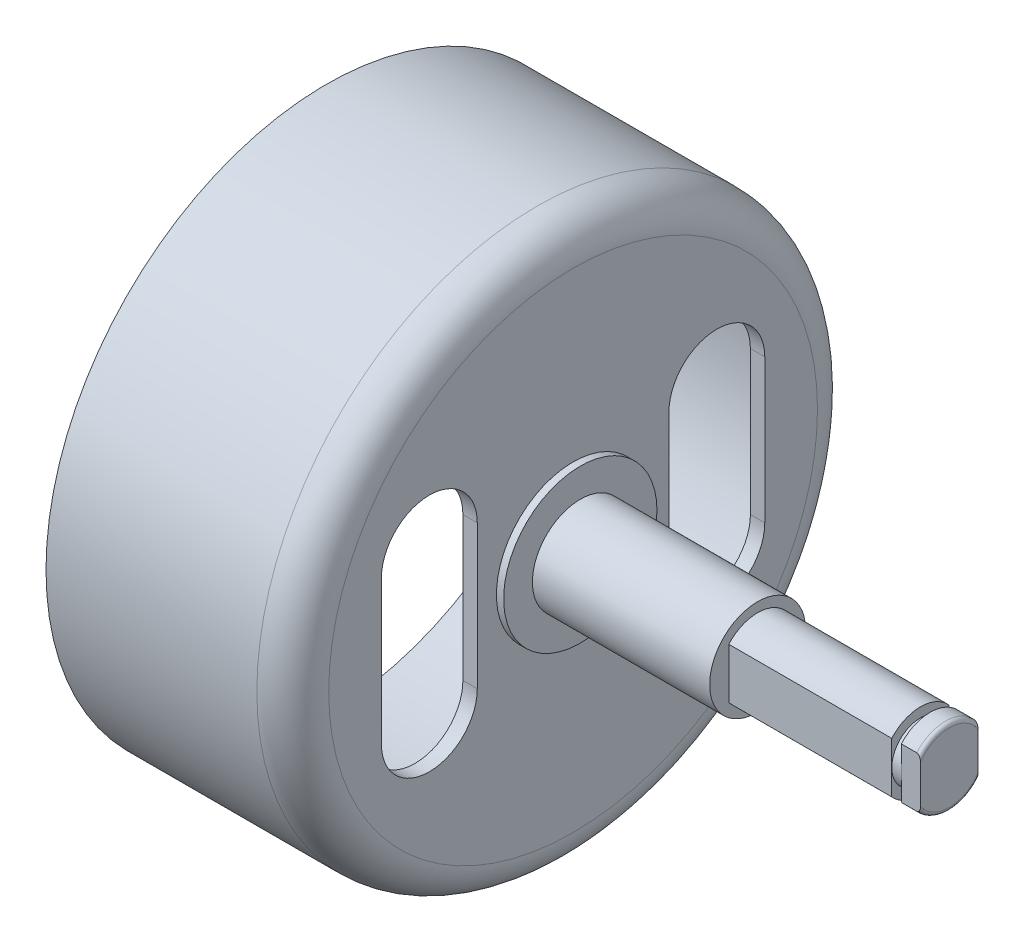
ISO-10303-21;
HEADER;
FILE_DESCRIPTION(('STEP AP214'),'2;1');
FILE_NAME('part.step','',(''),(''),'','','');
FILE_SCHEMA(('AUTOMOTIVE_DESIGN { 1 0 10303 214 1 1 1 1 }'));
ENDSEC;
DATA;
#1=APPLICATION_CONTEXT('core data for automotive mechanical design processes');
#2=APPLICATION_PROTOCOL_DEFINITION('international standard','automotive_design',2000,#1);
#3=PRODUCT_CONTEXT('',#1,'mechanical');
#4=PRODUCT('Part','Part','',(#3));
#5=PRODUCT_RELATED_PRODUCT_CATEGORY('part','',(#4));
#6=PRODUCT_DEFINITION_FORMATION('','',#4);
#7=PRODUCT_DEFINITION_CONTEXT('part definition',#1,'design');
#8=PRODUCT_DEFINITION('design','',#6,#7);
#9=PRODUCT_DEFINITION_SHAPE('','',#8);
#10=(LENGTH_UNIT() NAMED_UNIT(*) SI_UNIT(.MILLI.,.METRE.));
#11=(NAMED_UNIT(*) PLANE_ANGLE_UNIT() SI_UNIT($,.RADIAN.));
#12=(NAMED_UNIT(*) SI_UNIT($,.STERADIAN.) SOLID_ANGLE_UNIT());
#13=UNCERTAINTY_MEASURE_WITH_UNIT(LENGTH_MEASURE(1.E-05),#10,'distance_accuracy_value','');
#14=(GEOMETRIC_REPRESENTATION_CONTEXT(3) GLOBAL_UNCERTAINTY_ASSIGNED_CONTEXT((#13)) GLOBAL_UNIT_ASSIGNED_CONTEXT((#10,
#11,#12)) REPRESENTATION_CONTEXT('',''));
#15=CARTESIAN_POINT('',(0.,0.,0.));
#16=DIRECTION('',(0.,0.,1.));
#17=DIRECTION('',(1.,0.,0.));
#18=AXIS2_PLACEMENT_3D('',#15,#16,#17);
#19=CARTESIAN_POINT('',(39.6,0.,0.));
#20=DIRECTION('',(1.,0.,0.));
#21=DIRECTION('',(0.,0.99999889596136,0.00148595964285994));
#22=AXIS2_PLACEMENT_3D('',#19,#20,#21);
#23=TOROIDAL_SURFACE('',#22,3.6,0.4);
#24=CARTESIAN_POINT('',(40.,0.,0.));
#25=DIRECTION('',(-1.,0.,0.));
#26=DIRECTION('',(0.,-0.55277079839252,-0.833333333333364));
#27=AXIS2_PLACEMENT_3D('',#24,#25,#26);
#28=CIRCLE('',#27,3.59999999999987);
#29=CARTESIAN_POINT('',(40.,-3.59999602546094,-0.00534945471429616));
#30=VERTEX_POINT('',#29);
#31=CARTESIAN_POINT('',(40.,-1.989974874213,-3.));
#32=VERTEX_POINT('',#31);
#33=EDGE_CURVE('E385',#30,#32,#28,.F.);
#34=ORIENTED_EDGE('',*,*,#33,.F.);
#35=CARTESIAN_POINT('',(40.,0.,0.));
#36=DIRECTION('',(-1.,0.,0.));
#37=DIRECTION('',(0.,-0.999998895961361,-0.00148595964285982));
#38=AXIS2_PLACEMENT_3D('',#35,#36,#37);
#39=CIRCLE('',#38,3.6000000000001);
#40=CARTESIAN_POINT('',(40.,-1.98997487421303,3.00000000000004));
#41=VERTEX_POINT('',#40);
#42=EDGE_CURVE('E375',#41,#30,#39,.F.);
#43=ORIENTED_EDGE('',*,*,#42,.F.);
#44=CARTESIAN_POINT('',(40.,-1.98997487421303,3.));
#45=CARTESIAN_POINT('',(39.9999854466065,-2.02218015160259,3.));
#46=CARTESIAN_POINT('',(39.9988094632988,-2.05441692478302,3.));
#47=CARTESIAN_POINT('',(39.9937777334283,-2.11888113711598,3.));
#48=CARTESIAN_POINT('',(39.9899050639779,-2.15110722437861,3.));
#49=CARTESIAN_POINT('',(39.9790378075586,-2.21551711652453,3.));
#50=CARTESIAN_POINT('',(39.9719996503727,-2.24769381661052,3.00000000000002));
#51=CARTESIAN_POINT('',(39.954321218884,-2.31097519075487,2.99999999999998));
#52=CARTESIAN_POINT('',(39.9436915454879,-2.34208272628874,2.99999999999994));
#53=CARTESIAN_POINT('',(39.9212199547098,-2.3954558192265,2.99999999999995));
#54=CARTESIAN_POINT('',(39.9102468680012,-2.4180841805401,2.99999999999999));
#55=CARTESIAN_POINT('',(39.8855439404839,-2.4617702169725,3.00000000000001));
#56=CARTESIAN_POINT('',(39.8718182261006,-2.48283017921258,3.));
#57=CARTESIAN_POINT('',(39.8410999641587,-2.52292305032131,3.));
#58=CARTESIAN_POINT('',(39.8240652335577,-2.54192423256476,3.));
#59=CARTESIAN_POINT('',(39.7866918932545,-2.57636067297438,3.));
#60=CARTESIAN_POINT('',(39.7663633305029,-2.5918064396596,3.));
#61=CARTESIAN_POINT('',(39.7307308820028,-2.61287281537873,3.));
#62=CARTESIAN_POINT('',(39.7163246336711,-2.62001832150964,3.));
#63=CARTESIAN_POINT('',(39.6865490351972,-2.63186400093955,3.));
#64=CARTESIAN_POINT('',(39.671181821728,-2.63656939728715,3.));
#65=CARTESIAN_POINT('',(39.6464138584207,-2.64182701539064,3.));
#66=CARTESIAN_POINT('',(39.6371998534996,-2.643292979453,3.));
#67=CARTESIAN_POINT('',(39.618659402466,-2.64525721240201,3.));
#68=CARTESIAN_POINT('',(39.6093328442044,-2.64575441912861,3.));
#69=CARTESIAN_POINT('',(39.6,-2.64575131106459,3.));
#70=B_SPLINE_CURVE_WITH_KNOTS('',3,(#44,#45,#46,#47,#48,#49,#50,#51,#52,#53,#54,#55,#56,#57,#58,
#59,#60,#61,#62,#63,#64,#65,#66,#67,#68,#69),.UNSPECIFIED.,.F.,.F.,(4,2,2,2,2,2,2,2,2,2,2,2,4),
(0.,0.0966432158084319,0.193898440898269,0.292535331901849,0.390883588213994,0.466168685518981,
0.541341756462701,0.617544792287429,0.69351962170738,0.74158361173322,0.789544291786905,
0.817487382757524,0.845461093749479),.UNSPECIFIED.);
#71=CARTESIAN_POINT('',(39.6,-2.6457513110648,3.));
#72=VERTEX_POINT('',#71);
#73=EDGE_CURVE('E177',#41,#72,#70,.T.);
#74=ORIENTED_EDGE('',*,*,#73,.T.);
#75=CARTESIAN_POINT('',(39.6,0.,0.));
#76=DIRECTION('',(1.,0.,0.));
#77=DIRECTION('',(0.,0.,-1.));
#78=AXIS2_PLACEMENT_3D('',#75,#76,#77);
#79=CIRCLE('',#78,4.);
#80=CARTESIAN_POINT('',(39.6,-2.64575131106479,-3.));
#81=VERTEX_POINT('',#80);
#82=EDGE_CURVE('E172',#81,#72,#79,.F.);
#83=ORIENTED_EDGE('',*,*,#82,.F.);
#84=CARTESIAN_POINT('',(39.6,-2.64575131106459,-3.));
#85=CARTESIAN_POINT('',(39.6171201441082,-2.64579447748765,-3.));
#86=CARTESIAN_POINT('',(39.6341926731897,-2.64409273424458,-3.));
#87=CARTESIAN_POINT('',(39.6675754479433,-2.63757875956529,-3.));
#88=CARTESIAN_POINT('',(39.6838913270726,-2.63279575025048,-3.));
#89=CARTESIAN_POINT('',(39.7153847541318,-2.62050486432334,-3.));
#90=CARTESIAN_POINT('',(39.7305656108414,-2.61300531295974,-3.));
#91=CARTESIAN_POINT('',(39.7596153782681,-2.59575979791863,-3.));
#92=CARTESIAN_POINT('',(39.773480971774,-2.58600835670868,-3.));
#93=CARTESIAN_POINT('',(39.824287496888,-2.5448620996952,-3.));
#94=CARTESIAN_POINT('',(39.8560493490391,-2.50701337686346,-3.));
#95=CARTESIAN_POINT('',(39.9020393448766,-2.43498895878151,-3.));
#96=CARTESIAN_POINT('',(39.9186504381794,-2.40214024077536,-3.));
#97=CARTESIAN_POINT('',(39.946759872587,-2.33413869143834,-3.));
#98=CARTESIAN_POINT('',(39.958234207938,-2.2989759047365,-3.));
#99=CARTESIAN_POINT('',(39.9791069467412,-2.2183887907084,-3.));
#100=CARTESIAN_POINT('',(39.9872215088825,-2.17264234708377,-3.));
#101=CARTESIAN_POINT('',(39.9950441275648,-2.10392295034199,-3.));
#102=CARTESIAN_POINT('',(39.9969284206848,-2.08116006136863,-3.));
#103=CARTESIAN_POINT('',(39.9994042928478,-2.03559092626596,-3.));
#104=CARTESIAN_POINT('',(39.9999974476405,-2.01278476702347,-3.));
#105=CARTESIAN_POINT('',(40.,-1.989974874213,-3.));
#106=B_SPLINE_CURVE_WITH_KNOTS('',3,(#84,#85,#86,#87,#88,#89,#90,#91,#92,#93,#94,#95,#96,#97,
#98,#99,#100,#101,#102,#103,#104,#105),.UNSPECIFIED.,.F.,.F.,(4,2,2,2,2,2,2,2,2,2,4),(0.,
0.0512004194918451,0.101922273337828,0.152489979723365,0.203182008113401,0.348391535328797,
0.45846752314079,0.569052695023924,0.707953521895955,0.77644842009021,0.844859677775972),.UNSPECIFIED.);
#107=EDGE_CURVE('E174',#81,#32,#106,.T.);
#108=ORIENTED_EDGE('',*,*,#107,.T.);
#109=EDGE_LOOP('',(#34,#43,#74,#83,#108));
#110=FACE_BOUND('',#109,.T.);
#111=ADVANCED_FACE('F17',(#110),#23,.T.);
#112=CARTESIAN_POINT('',(39.6,0.,0.));
#113=DIRECTION('',(1.,0.,0.));
#114=DIRECTION('',(0.,-0.99999889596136,-0.00148595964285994));
#115=AXIS2_PLACEMENT_3D('',#112,#113,#114);
#116=TOROIDAL_SURFACE('',#115,3.6,0.4);
#117=CARTESIAN_POINT('',(40.,0.,0.));
#118=DIRECTION('',(-1.,0.,0.));
#119=DIRECTION('',(0.,0.55277079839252,0.833333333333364));
#120=AXIS2_PLACEMENT_3D('',#117,#118,#119);
#121=CIRCLE('',#120,3.59999999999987);
#122=CARTESIAN_POINT('',(40.,3.59999602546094,0.00534945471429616));
#123=VERTEX_POINT('',#122);
#124=CARTESIAN_POINT('',(40.,1.989974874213,3.));
#125=VERTEX_POINT('',#124);
#126=EDGE_CURVE('E182',#123,#125,#121,.F.);
#127=ORIENTED_EDGE('',*,*,#126,.F.);
#128=CARTESIAN_POINT('',(40.,0.,0.));
#129=DIRECTION('',(-1.,0.,0.));
#130=DIRECTION('',(0.,0.999998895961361,0.00148595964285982));
#131=AXIS2_PLACEMENT_3D('',#128,#129,#130);
#132=CIRCLE('',#131,3.6000000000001);
#133=CARTESIAN_POINT('',(40.,1.98997487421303,-3.00000000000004));
#134=VERTEX_POINT('',#133);
#135=EDGE_CURVE('E395',#134,#123,#132,.F.);
#136=ORIENTED_EDGE('',*,*,#135,.F.);
#137=CARTESIAN_POINT('',(40.,1.98997487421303,-3.));
#138=CARTESIAN_POINT('',(39.9999854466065,2.02218015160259,-3.));
#139=CARTESIAN_POINT('',(39.9988094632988,2.05441692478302,-3.));
#140=CARTESIAN_POINT('',(39.9937777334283,2.11888113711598,-3.));
#141=CARTESIAN_POINT('',(39.9899050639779,2.15110722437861,-3.));
#142=CARTESIAN_POINT('',(39.9790378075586,2.21551711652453,-3.));
#143=CARTESIAN_POINT('',(39.9719996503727,2.24769381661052,-3.00000000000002));
#144=CARTESIAN_POINT('',(39.954321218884,2.31097519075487,-2.99999999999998));
#145=CARTESIAN_POINT('',(39.9436915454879,2.34208272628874,-2.99999999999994));
#146=CARTESIAN_POINT('',(39.9212199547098,2.3954558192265,-2.99999999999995));
#147=CARTESIAN_POINT('',(39.9102468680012,2.4180841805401,-2.99999999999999));
#148=CARTESIAN_POINT('',(39.8855439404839,2.4617702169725,-3.00000000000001));
#149=CARTESIAN_POINT('',(39.8718182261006,2.48283017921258,-3.));
#150=CARTESIAN_POINT('',(39.8410999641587,2.52292305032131,-3.));
#151=CARTESIAN_POINT('',(39.8240652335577,2.54192423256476,-3.));
#152=CARTESIAN_POINT('',(39.7866918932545,2.57636067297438,-3.));
#153=CARTESIAN_POINT('',(39.7663633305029,2.5918064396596,-3.));
#154=CARTESIAN_POINT('',(39.7307308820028,2.61287281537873,-3.));
#155=CARTESIAN_POINT('',(39.7163246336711,2.62001832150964,-3.));
#156=CARTESIAN_POINT('',(39.6865490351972,2.63186400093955,-3.));
#157=CARTESIAN_POINT('',(39.671181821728,2.63656939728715,-3.));
#158=CARTESIAN_POINT('',(39.6464138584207,2.64182701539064,-3.));
#159=CARTESIAN_POINT('',(39.6371998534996,2.643292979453,-3.));
#160=CARTESIAN_POINT('',(39.618659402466,2.64525721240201,-3.));
#161=CARTESIAN_POINT('',(39.6093328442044,2.64575441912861,-3.));
#162=CARTESIAN_POINT('',(39.6,2.64575131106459,-3.));
#163=B_SPLINE_CURVE_WITH_KNOTS('',3,(#137,#138,#139,#140,#141,#142,#143,#144,#145,#146,#147,
#148,#149,#150,#151,#152,#153,#154,#155,#156,#157,#158,#159,#160,#161,#162),.UNSPECIFIED.,.F.,
.F.,(4,2,2,2,2,2,2,2,2,2,2,2,4),(0.,0.0966432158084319,0.193898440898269,0.292535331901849,
0.390883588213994,0.466168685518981,0.541341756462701,0.617544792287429,0.69351962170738,
0.74158361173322,0.789544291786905,0.817487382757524,0.845461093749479),.UNSPECIFIED.);
#164=CARTESIAN_POINT('',(39.6,2.6457513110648,-3.));
#165=VERTEX_POINT('',#164);
#166=EDGE_CURVE('E192',#134,#165,#163,.T.);
#167=ORIENTED_EDGE('',*,*,#166,.T.);
#168=CARTESIAN_POINT('',(39.6,0.,0.));
#169=DIRECTION('',(1.,0.,0.));
#170=DIRECTION('',(0.,0.,-1.));
#171=AXIS2_PLACEMENT_3D('',#168,#169,#170);
#172=CIRCLE('',#171,4.);
#173=CARTESIAN_POINT('',(39.6,2.64575131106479,3.));
#174=VERTEX_POINT('',#173);
#175=EDGE_CURVE('E181',#174,#165,#172,.F.);
#176=ORIENTED_EDGE('',*,*,#175,.F.);
#177=CARTESIAN_POINT('',(39.6,2.64575131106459,3.));
#178=CARTESIAN_POINT('',(39.6171201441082,2.64579447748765,3.));
#179=CARTESIAN_POINT('',(39.6341926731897,2.64409273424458,3.));
#180=CARTESIAN_POINT('',(39.6675754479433,2.63757875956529,3.));
#181=CARTESIAN_POINT('',(39.6838913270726,2.63279575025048,3.));
#182=CARTESIAN_POINT('',(39.7153847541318,2.62050486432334,3.));
#183=CARTESIAN_POINT('',(39.7305656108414,2.61300531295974,3.));
#184=CARTESIAN_POINT('',(39.7596153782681,2.59575979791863,3.));
#185=CARTESIAN_POINT('',(39.773480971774,2.58600835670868,3.));
#186=CARTESIAN_POINT('',(39.824287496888,2.5448620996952,3.));
#187=CARTESIAN_POINT('',(39.8560493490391,2.50701337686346,3.));
#188=CARTESIAN_POINT('',(39.9020393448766,2.43498895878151,3.));
#189=CARTESIAN_POINT('',(39.9186504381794,2.40214024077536,3.));
#190=CARTESIAN_POINT('',(39.946759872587,2.33413869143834,3.));
#191=CARTESIAN_POINT('',(39.958234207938,2.2989759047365,3.));
#192=CARTESIAN_POINT('',(39.9791069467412,2.2183887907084,3.));
#193=CARTESIAN_POINT('',(39.9872215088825,2.17264234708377,3.));
#194=CARTESIAN_POINT('',(39.9950441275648,2.10392295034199,3.));
#195=CARTESIAN_POINT('',(39.9969284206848,2.08116006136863,3.));
#196=CARTESIAN_POINT('',(39.9994042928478,2.03559092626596,3.));
#197=CARTESIAN_POINT('',(39.9999974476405,2.01278476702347,3.));
#198=CARTESIAN_POINT('',(40.,1.989974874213,3.));
#199=B_SPLINE_CURVE_WITH_KNOTS('',3,(#177,#178,#179,#180,#181,#182,#183,#184,#185,#186,#187,
#188,#189,#190,#191,#192,#193,#194,#195,#196,#197,#198),.UNSPECIFIED.,.F.,.F.,(4,2,2,2,2,2,2,2,
2,2,4),(0.,0.0512004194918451,0.101922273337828,0.152489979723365,0.203182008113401,
0.348391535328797,0.45846752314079,0.569052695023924,0.707953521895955,0.77644842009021,
0.844859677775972),.UNSPECIFIED.);
#200=EDGE_CURVE('E431',#174,#125,#199,.T.);
#201=ORIENTED_EDGE('',*,*,#200,.T.);
#202=EDGE_LOOP('',(#127,#136,#167,#176,#201));
#203=FACE_BOUND('',#202,.T.);
#204=ADVANCED_FACE('F349',(#203),#116,.T.);
#205=CARTESIAN_POINT('',(40.,0.,0.));
#206=DIRECTION('',(1.,0.,0.));
#207=DIRECTION('',(0.,0.,-1.));
#208=AXIS2_PLACEMENT_3D('',#205,#206,#207);
#209=PLANE('',#208);
#210=ORIENTED_EDGE('',*,*,#135,.T.);
#211=ORIENTED_EDGE('',*,*,#126,.T.);
#212=DIRECTION('',(0.,1.,0.));
#213=VECTOR('',#212,1.);
#214=CARTESIAN_POINT('',(40.,2.645751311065,3.));
#215=LINE('',#214,#213);
#216=EDGE_CURVE('E416',#41,#125,#215,.T.);
#217=ORIENTED_EDGE('',*,*,#216,.F.);
#218=ORIENTED_EDGE('',*,*,#42,.T.);
#219=ORIENTED_EDGE('',*,*,#33,.T.);
#220=DIRECTION('',(0.,1.,0.));
#221=VECTOR('',#220,1.);
#222=CARTESIAN_POINT('',(40.,-2.645751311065,-3.));
#223=LINE('',#222,#221);
#224=EDGE_CURVE('E191',#134,#32,#223,.F.);
#225=ORIENTED_EDGE('',*,*,#224,.F.);
#226=EDGE_LOOP('',(#210,#211,#217,#218,#219,#225));
#227=FACE_BOUND('',#226,.T.);
#228=ADVANCED_FACE('F360',(#227),#209,.T.);
#229=CARTESIAN_POINT('',(20.,0.,0.));
#230=DIRECTION('',(1.,0.,0.));
#231=DIRECTION('',(0.,0.,-1.));
#232=AXIS2_PLACEMENT_3D('',#229,#230,#231);
#233=CYLINDRICAL_SURFACE('',#232,4.);
#234=DIRECTION('',(1.,0.,0.));
#235=VECTOR('',#234,1.);
#236=CARTESIAN_POINT('',(20.,-2.645751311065,3.));
#237=LINE('',#236,#235);
#238=CARTESIAN_POINT('',(38.,-2.6457513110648,3.));
#239=VERTEX_POINT('',#238);
#240=EDGE_CURVE('E204',#239,#72,#237,.T.);
#241=ORIENTED_EDGE('',*,*,#240,.F.);
#242=CARTESIAN_POINT('',(38.,0.,0.));
#243=DIRECTION('',(1.,0.,0.));
#244=DIRECTION('',(0.,0.,-1.));
#245=AXIS2_PLACEMENT_3D('',#242,#243,#244);
#246=CIRCLE('',#245,4.);
#247=CARTESIAN_POINT('',(38.,-2.6457513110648,-3.));
#248=VERTEX_POINT('',#247);
#249=EDGE_CURVE('E196',#239,#248,#246,.T.);
#250=ORIENTED_EDGE('',*,*,#249,.T.);
#251=DIRECTION('',(-1.,0.,0.));
#252=VECTOR('',#251,1.);
#253=CARTESIAN_POINT('',(20.,-2.645751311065,-3.));
#254=LINE('',#253,#252);
#255=EDGE_CURVE('E188',#81,#248,#254,.T.);
#256=ORIENTED_EDGE('',*,*,#255,.F.);
#257=ORIENTED_EDGE('',*,*,#82,.T.);
#258=EDGE_LOOP('',(#241,#250,#256,#257));
#259=FACE_BOUND('',#258,.T.);
#260=ADVANCED_FACE('F194',(#259),#233,.T.);
#261=CARTESIAN_POINT('',(20.,0.,0.));
#262=DIRECTION('',(1.,0.,0.));
#263=DIRECTION('',(0.,0.,-1.));
#264=AXIS2_PLACEMENT_3D('',#261,#262,#263);
#265=CYLINDRICAL_SURFACE('',#264,4.);
#266=DIRECTION('',(-1.,0.,0.));
#267=VECTOR('',#266,1.);
#268=CARTESIAN_POINT('',(20.,2.645751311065,-3.));
#269=LINE('',#268,#267);
#270=CARTESIAN_POINT('',(38.,2.6457513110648,-3.));
#271=VERTEX_POINT('',#270);
#272=EDGE_CURVE('E201',#271,#165,#269,.F.);
#273=ORIENTED_EDGE('',*,*,#272,.F.);
#274=CARTESIAN_POINT('',(38.,0.,0.));
#275=DIRECTION('',(1.,0.,0.));
#276=DIRECTION('',(0.,0.,-1.));
#277=AXIS2_PLACEMENT_3D('',#274,#275,#276);
#278=CIRCLE('',#277,4.);
#279=CARTESIAN_POINT('',(38.,2.6457513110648,3.));
#280=VERTEX_POINT('',#279);
#281=EDGE_CURVE('E213',#271,#280,#278,.T.);
#282=ORIENTED_EDGE('',*,*,#281,.T.);
#283=DIRECTION('',(1.,0.,0.));
#284=VECTOR('',#283,1.);
#285=CARTESIAN_POINT('',(20.,2.645751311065,3.));
#286=LINE('',#285,#284);
#287=EDGE_CURVE('E211',#174,#280,#286,.F.);
#288=ORIENTED_EDGE('',*,*,#287,.F.);
#289=ORIENTED_EDGE('',*,*,#175,.T.);
#290=EDGE_LOOP('',(#273,#282,#288,#289));
#291=FACE_BOUND('',#290,.T.);
#292=ADVANCED_FACE('F443',(#291),#265,.T.);
#293=CARTESIAN_POINT('',(20.,2.645751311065,3.));
#294=DIRECTION('',(0.,0.,1.));
#295=DIRECTION('',(1.,0.,0.));
#296=AXIS2_PLACEMENT_3D('',#293,#294,#295);
#297=PLANE('',#296);
#298=ORIENTED_EDGE('',*,*,#287,.T.);
#299=DIRECTION('',(0.,1.,0.));
#300=VECTOR('',#299,1.);
#301=CARTESIAN_POINT('',(38.,0.,3.));
#302=LINE('',#301,#300);
#303=CARTESIAN_POINT('',(38.,0.,3.));
#304=VERTEX_POINT('',#303);
#305=EDGE_CURVE('E219',#280,#304,#302,.F.);
#306=ORIENTED_EDGE('',*,*,#305,.T.);
#307=DIRECTION('',(0.,1.,0.));
#308=VECTOR('',#307,1.);
#309=CARTESIAN_POINT('',(38.,0.,3.));
#310=LINE('',#309,#308);
#311=EDGE_CURVE('E197',#304,#239,#310,.F.);
#312=ORIENTED_EDGE('',*,*,#311,.T.);
#313=ORIENTED_EDGE('',*,*,#240,.T.);
#314=ORIENTED_EDGE('',*,*,#73,.F.);
#315=ORIENTED_EDGE('',*,*,#216,.T.);
#316=ORIENTED_EDGE('',*,*,#200,.F.);
#317=EDGE_LOOP('',(#298,#306,#312,#313,#314,#315,#316));
#318=FACE_BOUND('',#317,.T.);
#319=ADVANCED_FACE('F420',(#318),#297,.T.);
#320=CARTESIAN_POINT('',(20.,-2.645751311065,-3.));
#321=DIRECTION('',(0.,0.,-1.));
#322=DIRECTION('',(-1.,0.,0.));
#323=AXIS2_PLACEMENT_3D('',#320,#321,#322);
#324=PLANE('',#323);
#325=ORIENTED_EDGE('',*,*,#255,.T.);
#326=DIRECTION('',(0.,1.,0.));
#327=VECTOR('',#326,1.);
#328=CARTESIAN_POINT('',(38.,0.,-3.));
#329=LINE('',#328,#327);
#330=CARTESIAN_POINT('',(38.,0.,-3.));
#331=VERTEX_POINT('',#330);
#332=EDGE_CURVE('E212',#248,#331,#329,.T.);
#333=ORIENTED_EDGE('',*,*,#332,.T.);
#334=DIRECTION('',(0.,1.,0.));
#335=VECTOR('',#334,1.);
#336=CARTESIAN_POINT('',(38.,0.,-3.));
#337=LINE('',#336,#335);
#338=EDGE_CURVE('E215',#331,#271,#337,.T.);
#339=ORIENTED_EDGE('',*,*,#338,.T.);
#340=ORIENTED_EDGE('',*,*,#272,.T.);
#341=ORIENTED_EDGE('',*,*,#166,.F.);
#342=ORIENTED_EDGE('',*,*,#224,.T.);
#343=ORIENTED_EDGE('',*,*,#107,.F.);
#344=EDGE_LOOP('',(#325,#333,#339,#340,#341,#342,#343));
#345=FACE_BOUND('',#344,.T.);
#346=ADVANCED_FACE('F187',(#345),#324,.T.);
#347=CARTESIAN_POINT('',(38.,0.,0.));
#348=DIRECTION('',(1.,0.,0.));
#349=DIRECTION('',(0.,0.,-1.));
#350=AXIS2_PLACEMENT_3D('',#347,#348,#349);
#351=PLANE('',#350);
#352=ORIENTED_EDGE('',*,*,#332,.F.);
#353=ORIENTED_EDGE('',*,*,#249,.F.);
#354=ORIENTED_EDGE('',*,*,#311,.F.);
#355=CARTESIAN_POINT('',(38.,0.,0.));
#356=DIRECTION('',(1.,0.,0.));
#357=DIRECTION('',(0.,0.,-1.));
#358=AXIS2_PLACEMENT_3D('',#355,#356,#357);
#359=CIRCLE('',#358,3.);
#360=EDGE_CURVE('E218',#331,#304,#359,.F.);
#361=ORIENTED_EDGE('',*,*,#360,.F.);
#362=EDGE_LOOP('',(#352,#353,#354,#361));
#363=FACE_BOUND('',#362,.T.);
#364=ADVANCED_FACE('F426',(#363),#351,.F.);
#365=CARTESIAN_POINT('',(38.,0.,0.));
#366=DIRECTION('',(1.,0.,0.));
#367=DIRECTION('',(0.,0.,-1.));
#368=AXIS2_PLACEMENT_3D('',#365,#366,#367);
#369=PLANE('',#368);
#370=CARTESIAN_POINT('',(38.,0.,0.));
#371=DIRECTION('',(1.,0.,0.));
#372=DIRECTION('',(0.,0.,-1.));
#373=AXIS2_PLACEMENT_3D('',#370,#371,#372);
#374=CIRCLE('',#373,3.);
#375=EDGE_CURVE('E549',#304,#331,#374,.F.);
#376=ORIENTED_EDGE('',*,*,#375,.F.);
#377=ORIENTED_EDGE('',*,*,#305,.F.);
#378=ORIENTED_EDGE('',*,*,#281,.F.);
#379=ORIENTED_EDGE('',*,*,#338,.F.);
#380=EDGE_LOOP('',(#376,#377,#378,#379));
#381=FACE_BOUND('',#380,.T.);
#382=ADVANCED_FACE('F556',(#381),#369,.F.);
#383=CARTESIAN_POINT('',(38.,0.,0.));
#384=DIRECTION('',(1.,0.,0.));
#385=DIRECTION('',(0.,0.,-1.));
#386=AXIS2_PLACEMENT_3D('',#383,#384,#385);
#387=CYLINDRICAL_SURFACE('',#386,3.);
#388=CARTESIAN_POINT('',(37.,0.,0.));
#389=DIRECTION('',(1.,0.,0.));
#390=DIRECTION('',(0.,0.,-1.));
#391=AXIS2_PLACEMENT_3D('',#388,#389,#390);
#392=CIRCLE('',#391,3.);
#393=CARTESIAN_POINT('',(37.,0.,-3.));
#394=VERTEX_POINT('',#393);
#395=CARTESIAN_POINT('',(37.,0.,3.));
#396=VERTEX_POINT('',#395);
#397=EDGE_CURVE('E546',#394,#396,#392,.F.);
#398=ORIENTED_EDGE('',*,*,#397,.F.);
#399=CARTESIAN_POINT('',(37.,0.,0.));
#400=DIRECTION('',(1.,0.,0.));
#401=DIRECTION('',(0.,0.,-1.));
#402=AXIS2_PLACEMENT_3D('',#399,#400,#401);
#403=CIRCLE('',#402,3.);
#404=EDGE_CURVE('E329',#396,#394,#403,.F.);
#405=ORIENTED_EDGE('',*,*,#404,.F.);
#406=EDGE_LOOP('',(#398,#405));
#407=FACE_BOUND('',#406,.T.);
#408=ORIENTED_EDGE('',*,*,#375,.T.);
#409=ORIENTED_EDGE('',*,*,#360,.T.);
#410=EDGE_LOOP('',(#408,#409));
#411=FACE_BOUND('',#410,.T.);
#412=ADVANCED_FACE('F553',(#407,#411),#387,.T.);
#413=CARTESIAN_POINT('',(37.,0.,0.));
#414=DIRECTION('',(1.,0.,0.));
#415=DIRECTION('',(0.,0.,-1.));
#416=AXIS2_PLACEMENT_3D('',#413,#414,#415);
#417=PLANE('',#416);
#418=ORIENTED_EDGE('',*,*,#397,.T.);
#419=DIRECTION('',(0.,1.,0.));
#420=VECTOR('',#419,1.);
#421=CARTESIAN_POINT('',(37.,2.645751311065,3.));
#422=LINE('',#421,#420);
#423=CARTESIAN_POINT('',(37.,-2.6457513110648,3.));
#424=VERTEX_POINT('',#423);
#425=EDGE_CURVE('E319',#424,#396,#422,.T.);
#426=ORIENTED_EDGE('',*,*,#425,.F.);
#427=CARTESIAN_POINT('',(37.,0.,0.));
#428=DIRECTION('',(1.,0.,0.));
#429=DIRECTION('',(0.,0.,-1.));
#430=AXIS2_PLACEMENT_3D('',#427,#428,#429);
#431=CIRCLE('',#430,4.);
#432=CARTESIAN_POINT('',(37.,-2.64575131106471,-2.9999999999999));
#433=VERTEX_POINT('',#432);
#434=EDGE_CURVE('E320',#433,#424,#431,.F.);
#435=ORIENTED_EDGE('',*,*,#434,.F.);
#436=DIRECTION('',(0.,1.,0.));
#437=VECTOR('',#436,1.);
#438=CARTESIAN_POINT('',(37.,-2.645751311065,-3.));
#439=LINE('',#438,#437);
#440=EDGE_CURVE('E324',#394,#433,#439,.F.);
#441=ORIENTED_EDGE('',*,*,#440,.F.);
#442=EDGE_LOOP('',(#418,#426,#435,#441));
#443=FACE_BOUND('',#442,.T.);
#444=ADVANCED_FACE('F675',(#443),#417,.T.);
#445=CARTESIAN_POINT('',(37.,0.,0.));
#446=DIRECTION('',(1.,0.,0.));
#447=DIRECTION('',(0.,0.,-1.));
#448=AXIS2_PLACEMENT_3D('',#445,#446,#447);
#449=PLANE('',#448);
#450=DIRECTION('',(0.,1.,0.));
#451=VECTOR('',#450,1.);
#452=CARTESIAN_POINT('',(37.,-2.645751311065,-3.));
#453=LINE('',#452,#451);
#454=CARTESIAN_POINT('',(37.,2.64575131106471,-2.9999999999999));
#455=VERTEX_POINT('',#454);
#456=EDGE_CURVE('E326',#455,#394,#453,.F.);
#457=ORIENTED_EDGE('',*,*,#456,.F.);
#458=CARTESIAN_POINT('',(37.,0.,0.));
#459=DIRECTION('',(1.,0.,0.));
#460=DIRECTION('',(0.,0.,-1.));
#461=AXIS2_PLACEMENT_3D('',#458,#459,#460);
#462=CIRCLE('',#461,4.);
#463=CARTESIAN_POINT('',(37.,2.64575131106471,2.9999999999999));
#464=VERTEX_POINT('',#463);
#465=EDGE_CURVE('E229',#464,#455,#462,.F.);
#466=ORIENTED_EDGE('',*,*,#465,.F.);
#467=DIRECTION('',(0.,1.,0.));
#468=VECTOR('',#467,1.);
#469=CARTESIAN_POINT('',(37.,2.645751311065,3.));
#470=LINE('',#469,#468);
#471=EDGE_CURVE('E313',#396,#464,#470,.T.);
#472=ORIENTED_EDGE('',*,*,#471,.F.);
#473=ORIENTED_EDGE('',*,*,#404,.T.);
#474=EDGE_LOOP('',(#457,#466,#472,#473));
#475=FACE_BOUND('',#474,.T.);
#476=ADVANCED_FACE('F671',(#475),#449,.T.);
#477=CARTESIAN_POINT('',(20.,-2.645751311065,-3.));
#478=DIRECTION('',(0.,0.,-1.));
#479=DIRECTION('',(-1.,0.,0.));
#480=AXIS2_PLACEMENT_3D('',#477,#478,#479);
#481=PLANE('',#480);
#482=ORIENTED_EDGE('',*,*,#456,.T.);
#483=ORIENTED_EDGE('',*,*,#440,.T.);
#484=DIRECTION('',(1.,0.,0.));
#485=VECTOR('',#484,1.);
#486=CARTESIAN_POINT('',(20.,-2.64575131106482,-2.9999999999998));
#487=LINE('',#486,#485);
#488=CARTESIAN_POINT('',(20.,-2.64575131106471,-2.9999999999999));
#489=VERTEX_POINT('',#488);
#490=EDGE_CURVE('E321',#489,#433,#487,.T.);
#491=ORIENTED_EDGE('',*,*,#490,.F.);
#492=DIRECTION('',(0.,1.,0.));
#493=VECTOR('',#492,1.);
#494=CARTESIAN_POINT('',(20.,0.,-3.));
#495=LINE('',#494,#493);
#496=CARTESIAN_POINT('',(20.,2.64575131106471,-2.9999999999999));
#497=VERTEX_POINT('',#496);
#498=EDGE_CURVE('E226',#497,#489,#495,.F.);
#499=ORIENTED_EDGE('',*,*,#498,.F.);
#500=DIRECTION('',(1.,0.,0.));
#501=VECTOR('',#500,1.);
#502=CARTESIAN_POINT('',(20.,2.64575131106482,-2.9999999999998));
#503=LINE('',#502,#501);
#504=EDGE_CURVE('E309',#455,#497,#503,.F.);
#505=ORIENTED_EDGE('',*,*,#504,.F.);
#506=EDGE_LOOP('',(#482,#483,#491,#499,#505));
#507=FACE_BOUND('',#506,.T.);
#508=ADVANCED_FACE('F667',(#507),#481,.T.);
#509=CARTESIAN_POINT('',(20.,0.,0.));
#510=DIRECTION('',(1.,0.,0.));
#511=DIRECTION('',(0.,0.,-1.));
#512=AXIS2_PLACEMENT_3D('',#509,#510,#511);
#513=CYLINDRICAL_SURFACE('',#512,4.);
#514=ORIENTED_EDGE('',*,*,#490,.T.);
#515=ORIENTED_EDGE('',*,*,#434,.T.);
#516=DIRECTION('',(1.,0.,0.));
#517=VECTOR('',#516,1.);
#518=CARTESIAN_POINT('',(20.,-2.645751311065,3.));
#519=LINE('',#518,#517);
#520=CARTESIAN_POINT('',(20.,-2.6457513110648,3.));
#521=VERTEX_POINT('',#520);
#522=EDGE_CURVE('E316',#521,#424,#519,.T.);
#523=ORIENTED_EDGE('',*,*,#522,.F.);
#524=CARTESIAN_POINT('',(20.,0.,0.));
#525=DIRECTION('',(1.,0.,0.));
#526=DIRECTION('',(0.,0.,-1.));
#527=AXIS2_PLACEMENT_3D('',#524,#525,#526);
#528=CIRCLE('',#527,4.);
#529=EDGE_CURVE('E225',#489,#521,#528,.F.);
#530=ORIENTED_EDGE('',*,*,#529,.F.);
#531=EDGE_LOOP('',(#514,#515,#523,#530));
#532=FACE_BOUND('',#531,.T.);
#533=ADVANCED_FACE('F663',(#532),#513,.T.);
#534=CARTESIAN_POINT('',(20.,2.645751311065,3.));
#535=DIRECTION('',(0.,0.,1.));
#536=DIRECTION('',(1.,0.,0.));
#537=AXIS2_PLACEMENT_3D('',#534,#535,#536);
#538=PLANE('',#537);
#539=ORIENTED_EDGE('',*,*,#425,.T.);
#540=ORIENTED_EDGE('',*,*,#471,.T.);
#541=DIRECTION('',(1.,0.,0.));
#542=VECTOR('',#541,1.);
#543=CARTESIAN_POINT('',(20.,2.64575131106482,2.9999999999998));
#544=LINE('',#543,#542);
#545=CARTESIAN_POINT('',(20.,2.64575131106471,2.9999999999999));
#546=VERTEX_POINT('',#545);
#547=EDGE_CURVE('E312',#546,#464,#544,.T.);
#548=ORIENTED_EDGE('',*,*,#547,.F.);
#549=DIRECTION('',(0.,1.,0.));
#550=VECTOR('',#549,1.);
#551=CARTESIAN_POINT('',(20.,0.,3.));
#552=LINE('',#551,#550);
#553=EDGE_CURVE('E221',#521,#546,#552,.T.);
#554=ORIENTED_EDGE('',*,*,#553,.F.);
#555=ORIENTED_EDGE('',*,*,#522,.T.);
#556=EDGE_LOOP('',(#539,#540,#548,#554,#555));
#557=FACE_BOUND('',#556,.T.);
#558=ADVANCED_FACE('F659',(#557),#538,.T.);
#559=CARTESIAN_POINT('',(20.,0.,0.));
#560=DIRECTION('',(1.,0.,0.));
#561=DIRECTION('',(0.,0.,-1.));
#562=AXIS2_PLACEMENT_3D('',#559,#560,#561);
#563=CYLINDRICAL_SURFACE('',#562,4.);
#564=ORIENTED_EDGE('',*,*,#547,.T.);
#565=ORIENTED_EDGE('',*,*,#465,.T.);
#566=ORIENTED_EDGE('',*,*,#504,.T.);
#567=CARTESIAN_POINT('',(20.,0.,0.));
#568=DIRECTION('',(1.,0.,0.));
#569=DIRECTION('',(0.,0.,-1.));
#570=AXIS2_PLACEMENT_3D('',#567,#568,#569);
#571=CIRCLE('',#570,4.);
#572=EDGE_CURVE('E224',#546,#497,#571,.F.);
#573=ORIENTED_EDGE('',*,*,#572,.F.);
#574=EDGE_LOOP('',(#564,#565,#566,#573));
#575=FACE_BOUND('',#574,.T.);
#576=ADVANCED_FACE('F655',(#575),#563,.T.);
#577=CARTESIAN_POINT('',(20.,0.,0.));
#578=DIRECTION('',(1.,0.,0.));
#579=DIRECTION('',(0.,0.,-1.));
#580=AXIS2_PLACEMENT_3D('',#577,#578,#579);
#581=PLANE('',#580);
#582=ORIENTED_EDGE('',*,*,#553,.T.);
#583=ORIENTED_EDGE('',*,*,#572,.T.);
#584=ORIENTED_EDGE('',*,*,#498,.T.);
#585=ORIENTED_EDGE('',*,*,#529,.T.);
#586=EDGE_LOOP('',(#582,#583,#584,#585));
#587=FACE_BOUND('',#586,.T.);
#588=CARTESIAN_POINT('',(20.,0.,0.));
#589=DIRECTION('',(1.,0.,0.));
#590=DIRECTION('',(0.,0.,-1.));
#591=AXIS2_PLACEMENT_3D('',#588,#589,#590);
#592=CIRCLE('',#591,5.);
#593=CARTESIAN_POINT('',(20.,0.,-5.));
#594=VERTEX_POINT('',#593);
#595=EDGE_CURVE('E534',#594,#594,#592,.F.);
#596=ORIENTED_EDGE('',*,*,#595,.F.);
#597=EDGE_LOOP('',(#596));
#598=FACE_BOUND('',#597,.T.);
#599=ADVANCED_FACE('F651',(#587,#598),#581,.T.);
#600=CARTESIAN_POINT('',(-3.,0.,0.));
#601=DIRECTION('',(1.,0.,0.));
#602=DIRECTION('',(0.,0.,-1.));
#603=AXIS2_PLACEMENT_3D('',#600,#601,#602);
#604=PLANE('',#603);
#605=CARTESIAN_POINT('',(-3.,0.,0.));
#606=DIRECTION('',(1.,0.,0.));
#607=DIRECTION('',(0.,0.,-1.));
#608=AXIS2_PLACEMENT_3D('',#605,#606,#607);
#609=CIRCLE('',#608,5.);
#610=CARTESIAN_POINT('',(-3.,0.,-5.));
#611=VERTEX_POINT('',#610);
#612=EDGE_CURVE('E531',#611,#611,#609,.T.);
#613=ORIENTED_EDGE('',*,*,#612,.F.);
#614=EDGE_LOOP('',(#613));
#615=FACE_BOUND('',#614,.T.);
#616=ADVANCED_FACE('F645',(#615),#604,.F.);
#617=CARTESIAN_POINT('',(-3.,0.,0.));
#618=DIRECTION('',(1.,0.,0.));
#619=DIRECTION('',(0.,0.,-1.));
#620=AXIS2_PLACEMENT_3D('',#617,#618,#619);
#621=CYLINDRICAL_SURFACE('',#620,5.);
#622=ORIENTED_EDGE('',*,*,#595,.T.);
#623=EDGE_LOOP('',(#622));
#624=FACE_BOUND('',#623,.T.);
#625=CARTESIAN_POINT('',(1.5,0.,0.));
#626=DIRECTION('',(1.,0.,0.));
#627=DIRECTION('',(0.,0.,-1.));
#628=AXIS2_PLACEMENT_3D('',#625,#626,#627);
#629=CIRCLE('',#628,5.);
#630=CARTESIAN_POINT('',(1.5,0.,-5.));
#631=VERTEX_POINT('',#630);
#632=EDGE_CURVE('E528',#631,#631,#629,.F.);
#633=ORIENTED_EDGE('',*,*,#632,.F.);
#634=EDGE_LOOP('',(#633));
#635=FACE_BOUND('',#634,.T.);
#636=ADVANCED_FACE('F638',(#624,#635),#621,.T.);
#637=CARTESIAN_POINT('',(-3.,0.,0.));
#638=DIRECTION('',(1.,0.,0.));
#639=DIRECTION('',(0.,0.,-1.));
#640=AXIS2_PLACEMENT_3D('',#637,#638,#639);
#641=CYLINDRICAL_SURFACE('',#640,5.);
#642=ORIENTED_EDGE('',*,*,#612,.T.);
#643=EDGE_LOOP('',(#642));
#644=FACE_BOUND('',#643,.T.);
#645=CARTESIAN_POINT('',(-0.75,0.,0.));
#646=DIRECTION('',(1.,0.,0.));
#647=DIRECTION('',(0.,0.,-1.));
#648=AXIS2_PLACEMENT_3D('',#645,#646,#647);
#649=CIRCLE('',#648,5.);
#650=CARTESIAN_POINT('',(-0.75,0.,-5.));
#651=VERTEX_POINT('',#650);
#652=EDGE_CURVE('E525',#651,#651,#649,.T.);
#653=ORIENTED_EDGE('',*,*,#652,.F.);
#654=EDGE_LOOP('',(#653));
#655=FACE_BOUND('',#654,.T.);
#656=ADVANCED_FACE('F636',(#644,#655),#641,.T.);
#657=CARTESIAN_POINT('',(1.5,0.,0.));
#658=DIRECTION('',(1.,0.,0.));
#659=DIRECTION('',(0.,0.,-1.));
#660=AXIS2_PLACEMENT_3D('',#657,#658,#659);
#661=PLANE('',#660);
#662=ORIENTED_EDGE('',*,*,#632,.T.);
#663=EDGE_LOOP('',(#662));
#664=FACE_BOUND('',#663,.T.);
#665=CARTESIAN_POINT('',(1.5,0.,0.));
#666=DIRECTION('',(1.,0.,0.));
#667=DIRECTION('',(0.,0.,-1.));
#668=AXIS2_PLACEMENT_3D('',#665,#666,#667);
#669=CIRCLE('',#668,8.);
#670=CARTESIAN_POINT('',(1.5,0.,-8.));
#671=VERTEX_POINT('',#670);
#672=EDGE_CURVE('E303',#671,#671,#669,.F.);
#673=ORIENTED_EDGE('',*,*,#672,.F.);
#674=EDGE_LOOP('',(#673));
#675=FACE_BOUND('',#674,.T.);
#676=ADVANCED_FACE('F251',(#664,#675),#661,.T.);
#677=CARTESIAN_POINT('',(-0.75,0.,0.));
#678=DIRECTION('',(-1.,0.,0.));
#679=DIRECTION('',(0.,0.,1.));
#680=AXIS2_PLACEMENT_3D('',#677,#678,#679);
#681=PLANE('',#680);
#682=DIRECTION('',(0.,1.,0.));
#683=VECTOR('',#682,1.);
#684=CARTESIAN_POINT('',(-0.75,-7.5,10.));
#685=LINE('',#684,#683);
#686=CARTESIAN_POINT('',(-0.75,-7.5,10.));
#687=VERTEX_POINT('',#686);
#688=CARTESIAN_POINT('',(-0.75,7.5,10.));
#689=VERTEX_POINT('',#688);
#690=EDGE_CURVE('E284',#687,#689,#685,.T.);
#691=ORIENTED_EDGE('',*,*,#690,.T.);
#692=CARTESIAN_POINT('',(-0.75,7.5,15.));
#693=DIRECTION('',(1.,0.,0.));
#694=DIRECTION('',(0.,0.,-1.));
#695=AXIS2_PLACEMENT_3D('',#692,#693,#694);
#696=CIRCLE('',#695,5.);
#697=CARTESIAN_POINT('',(-0.75,7.5,20.));
#698=VERTEX_POINT('',#697);
#699=EDGE_CURVE('E505',#689,#698,#696,.T.);
#700=ORIENTED_EDGE('',*,*,#699,.T.);
#701=DIRECTION('',(0.,1.,0.));
#702=VECTOR('',#701,1.);
#703=CARTESIAN_POINT('',(-0.75,7.5,20.));
#704=LINE('',#703,#702);
#705=CARTESIAN_POINT('',(-0.75,-7.5,20.));
#706=VERTEX_POINT('',#705);
#707=EDGE_CURVE('E294',#698,#706,#704,.F.);
#708=ORIENTED_EDGE('',*,*,#707,.T.);
#709=CARTESIAN_POINT('',(-0.75,-7.5,15.));
#710=DIRECTION('',(1.,0.,0.));
#711=DIRECTION('',(0.,0.,-1.));
#712=AXIS2_PLACEMENT_3D('',#709,#710,#711);
#713=CIRCLE('',#712,5.);
#714=EDGE_CURVE('E497',#706,#687,#713,.T.);
#715=ORIENTED_EDGE('',*,*,#714,.T.);
#716=EDGE_LOOP('',(#691,#700,#708,#715));
#717=FACE_BOUND('',#716,.T.);
#718=CARTESIAN_POINT('',(-0.75,7.5,-15.));
#719=DIRECTION('',(1.,0.,0.));
#720=DIRECTION('',(0.,0.,-1.));
#721=AXIS2_PLACEMENT_3D('',#718,#719,#720);
#722=CIRCLE('',#721,5.);
#723=CARTESIAN_POINT('',(-0.75,7.5,-20.));
#724=VERTEX_POINT('',#723);
#725=CARTESIAN_POINT('',(-0.75,7.5,-10.));
#726=VERTEX_POINT('',#725);
#727=EDGE_CURVE('E508',#724,#726,#722,.T.);
#728=ORIENTED_EDGE('',*,*,#727,.T.);
#729=DIRECTION('',(0.,1.,0.));
#730=VECTOR('',#729,1.);
#731=CARTESIAN_POINT('',(-0.75,7.5,-10.));
#732=LINE('',#731,#730);
#733=CARTESIAN_POINT('',(-0.75,-7.5,-10.));
#734=VERTEX_POINT('',#733);
#735=EDGE_CURVE('E299',#726,#734,#732,.F.);
#736=ORIENTED_EDGE('',*,*,#735,.T.);
#737=CARTESIAN_POINT('',(-0.75,-7.5,-15.));
#738=DIRECTION('',(1.,0.,0.));
#739=DIRECTION('',(0.,0.,-1.));
#740=AXIS2_PLACEMENT_3D('',#737,#738,#739);
#741=CIRCLE('',#740,5.);
#742=CARTESIAN_POINT('',(-0.75,-7.5,-20.));
#743=VERTEX_POINT('',#742);
#744=EDGE_CURVE('E512',#734,#743,#741,.T.);
#745=ORIENTED_EDGE('',*,*,#744,.T.);
#746=DIRECTION('',(0.,1.,0.));
#747=VECTOR('',#746,1.);
#748=CARTESIAN_POINT('',(-0.75,-7.5,-20.));
#749=LINE('',#748,#747);
#750=EDGE_CURVE('E304',#743,#724,#749,.T.);
#751=ORIENTED_EDGE('',*,*,#750,.T.);
#752=EDGE_LOOP('',(#728,#736,#745,#751));
#753=FACE_BOUND('',#752,.T.);
#754=ORIENTED_EDGE('',*,*,#652,.T.);
#755=EDGE_LOOP('',(#754));
#756=FACE_BOUND('',#755,.T.);
#757=CARTESIAN_POINT('',(-0.75,0.,0.));
#758=DIRECTION('',(1.,0.,0.));
#759=DIRECTION('',(0.,-1.,0.));
#760=AXIS2_PLACEMENT_3D('',#757,#758,#759);
#761=CIRCLE('',#760,25.5);
#762=CARTESIAN_POINT('',(-0.75,25.5,0.));
#763=VERTEX_POINT('',#762);
#764=CARTESIAN_POINT('',(-0.75,-25.5,0.));
#765=VERTEX_POINT('',#764);
#766=EDGE_CURVE('E233',#763,#765,#761,.F.);
#767=ORIENTED_EDGE('',*,*,#766,.T.);
#768=CARTESIAN_POINT('',(-0.75,0.,0.));
#769=DIRECTION('',(1.,0.,0.));
#770=DIRECTION('',(0.,1.,0.));
#771=AXIS2_PLACEMENT_3D('',#768,#769,#770);
#772=CIRCLE('',#771,25.5);
#773=EDGE_CURVE('E500',#765,#763,#772,.F.);
#774=ORIENTED_EDGE('',*,*,#773,.T.);
#775=EDGE_LOOP('',(#767,#774));
#776=FACE_BOUND('',#775,.T.);
#777=ADVANCED_FACE('F240',(#717,#753,#756,#776),#681,.T.);
#778=CARTESIAN_POINT('',(0.,0.,0.));
#779=DIRECTION('',(1.,0.,0.));
#780=DIRECTION('',(0.,0.,-1.));
#781=AXIS2_PLACEMENT_3D('',#778,#779,#780);
#782=CYLINDRICAL_SURFACE('',#781,8.);
#783=ORIENTED_EDGE('',*,*,#672,.T.);
#784=EDGE_LOOP('',(#783));
#785=FACE_BOUND('',#784,.T.);
#786=CARTESIAN_POINT('',(0.75,0.,0.));
#787=DIRECTION('',(1.,0.,0.));
#788=DIRECTION('',(0.,0.,-1.));
#789=AXIS2_PLACEMENT_3D('',#786,#787,#788);
#790=CIRCLE('',#789,8.);
#791=CARTESIAN_POINT('',(0.75,0.,-8.));
#792=VERTEX_POINT('',#791);
#793=EDGE_CURVE('E594',#792,#792,#790,.T.);
#794=ORIENTED_EDGE('',*,*,#793,.T.);
#795=EDGE_LOOP('',(#794));
#796=FACE_BOUND('',#795,.T.);
#797=ADVANCED_FACE('F250',(#785,#796),#782,.T.);
#798=CARTESIAN_POINT('',(0.75,7.5,-10.));
#799=DIRECTION('',(0.,0.,1.));
#800=DIRECTION('',(1.,0.,0.));
#801=AXIS2_PLACEMENT_3D('',#798,#799,#800);
#802=PLANE('',#801);
#803=ORIENTED_EDGE('',*,*,#735,.F.);
#804=DIRECTION('',(1.,0.,0.));
#805=VECTOR('',#804,1.);
#806=CARTESIAN_POINT('',(0.75,7.5,-10.));
#807=LINE('',#806,#805);
#808=CARTESIAN_POINT('',(0.75,7.5,-10.));
#809=VERTEX_POINT('',#808);
#810=EDGE_CURVE('E506',#726,#809,#807,.T.);
#811=ORIENTED_EDGE('',*,*,#810,.T.);
#812=DIRECTION('',(0.,1.,0.));
#813=VECTOR('',#812,1.);
#814=CARTESIAN_POINT('',(0.75,0.,-10.));
#815=LINE('',#814,#813);
#816=CARTESIAN_POINT('',(0.75,-7.5,-10.));
#817=VERTEX_POINT('',#816);
#818=EDGE_CURVE('E477',#809,#817,#815,.F.);
#819=ORIENTED_EDGE('',*,*,#818,.T.);
#820=DIRECTION('',(1.,0.,0.));
#821=VECTOR('',#820,1.);
#822=CARTESIAN_POINT('',(0.75,-7.5,-10.));
#823=LINE('',#822,#821);
#824=EDGE_CURVE('E302',#817,#734,#823,.F.);
#825=ORIENTED_EDGE('',*,*,#824,.T.);
#826=EDGE_LOOP('',(#803,#811,#819,#825));
#827=FACE_BOUND('',#826,.T.);
#828=ADVANCED_FACE('F782',(#827),#802,.F.);
#829=CARTESIAN_POINT('',(0.75,-7.5,-15.));
#830=DIRECTION('',(1.,0.,0.));
#831=DIRECTION('',(0.,0.,-1.));
#832=AXIS2_PLACEMENT_3D('',#829,#830,#831);
#833=CYLINDRICAL_SURFACE('',#832,5.);
#834=ORIENTED_EDGE('',*,*,#744,.F.);
#835=ORIENTED_EDGE('',*,*,#824,.F.);
#836=CARTESIAN_POINT('',(0.75,-7.5,-15.));
#837=DIRECTION('',(1.,0.,0.));
#838=DIRECTION('',(0.,0.,-1.));
#839=AXIS2_PLACEMENT_3D('',#836,#837,#838);
#840=CIRCLE('',#839,5.);
#841=CARTESIAN_POINT('',(0.75,-7.5,-20.));
#842=VERTEX_POINT('',#841);
#843=EDGE_CURVE('E592',#817,#842,#840,.T.);
#844=ORIENTED_EDGE('',*,*,#843,.T.);
#845=DIRECTION('',(-1.,0.,0.));
#846=VECTOR('',#845,1.);
#847=CARTESIAN_POINT('',(0.75,-7.5,-20.));
#848=LINE('',#847,#846);
#849=EDGE_CURVE('E308',#842,#743,#848,.T.);
#850=ORIENTED_EDGE('',*,*,#849,.T.);
#851=EDGE_LOOP('',(#834,#835,#844,#850));
#852=FACE_BOUND('',#851,.T.);
#853=ADVANCED_FACE('F789',(#852),#833,.F.);
#854=CARTESIAN_POINT('',(0.75,-7.5,-20.));
#855=DIRECTION('',(0.,0.,-1.));
#856=DIRECTION('',(-1.,0.,0.));
#857=AXIS2_PLACEMENT_3D('',#854,#855,#856);
#858=PLANE('',#857);
#859=ORIENTED_EDGE('',*,*,#750,.F.);
#860=ORIENTED_EDGE('',*,*,#849,.F.);
#861=DIRECTION('',(0.,1.,0.));
#862=VECTOR('',#861,1.);
#863=CARTESIAN_POINT('',(0.75,0.,-20.));
#864=LINE('',#863,#862);
#865=CARTESIAN_POINT('',(0.75,7.5,-20.));
#866=VERTEX_POINT('',#865);
#867=EDGE_CURVE('E591',#842,#866,#864,.T.);
#868=ORIENTED_EDGE('',*,*,#867,.T.);
#869=DIRECTION('',(1.,0.,0.));
#870=VECTOR('',#869,1.);
#871=CARTESIAN_POINT('',(0.75,7.5,-20.));
#872=LINE('',#871,#870);
#873=EDGE_CURVE('E307',#866,#724,#872,.F.);
#874=ORIENTED_EDGE('',*,*,#873,.T.);
#875=EDGE_LOOP('',(#859,#860,#868,#874));
#876=FACE_BOUND('',#875,.T.);
#877=ADVANCED_FACE('F627',(#876),#858,.F.);
#878=CARTESIAN_POINT('',(0.75,7.5,-15.));
#879=DIRECTION('',(1.,0.,0.));
#880=DIRECTION('',(0.,0.,-1.));
#881=AXIS2_PLACEMENT_3D('',#878,#879,#880);
#882=CYLINDRICAL_SURFACE('',#881,5.);
#883=ORIENTED_EDGE('',*,*,#727,.F.);
#884=ORIENTED_EDGE('',*,*,#873,.F.);
#885=CARTESIAN_POINT('',(0.75,7.5,-15.));
#886=DIRECTION('',(1.,0.,0.));
#887=DIRECTION('',(0.,0.,-1.));
#888=AXIS2_PLACEMENT_3D('',#885,#886,#887);
#889=CIRCLE('',#888,5.);
#890=EDGE_CURVE('E588',#866,#809,#889,.T.);
#891=ORIENTED_EDGE('',*,*,#890,.T.);
#892=ORIENTED_EDGE('',*,*,#810,.F.);
#893=EDGE_LOOP('',(#883,#884,#891,#892));
#894=FACE_BOUND('',#893,.T.);
#895=ADVANCED_FACE('F630',(#894),#882,.F.);
#896=CARTESIAN_POINT('',(0.75,7.5,15.));
#897=DIRECTION('',(1.,0.,0.));
#898=DIRECTION('',(0.,0.,-1.));
#899=AXIS2_PLACEMENT_3D('',#896,#897,#898);
#900=CYLINDRICAL_SURFACE('',#899,5.);
#901=ORIENTED_EDGE('',*,*,#699,.F.);
#902=DIRECTION('',(-1.,0.,0.));
#903=VECTOR('',#902,1.);
#904=CARTESIAN_POINT('',(0.75,7.5,10.));
#905=LINE('',#904,#903);
#906=CARTESIAN_POINT('',(0.75,7.5,10.));
#907=VERTEX_POINT('',#906);
#908=EDGE_CURVE('E292',#689,#907,#905,.F.);
#909=ORIENTED_EDGE('',*,*,#908,.T.);
#910=CARTESIAN_POINT('',(0.75,7.5,15.));
#911=DIRECTION('',(1.,0.,0.));
#912=DIRECTION('',(0.,0.,-1.));
#913=AXIS2_PLACEMENT_3D('',#910,#911,#912);
#914=CIRCLE('',#913,5.);
#915=CARTESIAN_POINT('',(0.75,7.5,20.));
#916=VERTEX_POINT('',#915);
#917=EDGE_CURVE('E586',#907,#916,#914,.T.);
#918=ORIENTED_EDGE('',*,*,#917,.T.);
#919=DIRECTION('',(1.,0.,0.));
#920=VECTOR('',#919,1.);
#921=CARTESIAN_POINT('',(0.75,7.5,20.));
#922=LINE('',#921,#920);
#923=EDGE_CURVE('E298',#916,#698,#922,.F.);
#924=ORIENTED_EDGE('',*,*,#923,.T.);
#925=EDGE_LOOP('',(#901,#909,#918,#924));
#926=FACE_BOUND('',#925,.T.);
#927=ADVANCED_FACE('F602',(#926),#900,.F.);
#928=CARTESIAN_POINT('',(0.75,7.5,20.));
#929=DIRECTION('',(0.,0.,1.));
#930=DIRECTION('',(1.,0.,0.));
#931=AXIS2_PLACEMENT_3D('',#928,#929,#930);
#932=PLANE('',#931);
#933=ORIENTED_EDGE('',*,*,#707,.F.);
#934=ORIENTED_EDGE('',*,*,#923,.F.);
#935=DIRECTION('',(0.,1.,0.));
#936=VECTOR('',#935,1.);
#937=CARTESIAN_POINT('',(0.75,0.,20.));
#938=LINE('',#937,#936);
#939=CARTESIAN_POINT('',(0.75,-7.5,20.));
#940=VERTEX_POINT('',#939);
#941=EDGE_CURVE('E585',#916,#940,#938,.F.);
#942=ORIENTED_EDGE('',*,*,#941,.T.);
#943=DIRECTION('',(1.,0.,0.));
#944=VECTOR('',#943,1.);
#945=CARTESIAN_POINT('',(0.75,-7.5,20.));
#946=LINE('',#945,#944);
#947=EDGE_CURVE('E297',#940,#706,#946,.F.);
#948=ORIENTED_EDGE('',*,*,#947,.T.);
#949=EDGE_LOOP('',(#933,#934,#942,#948));
#950=FACE_BOUND('',#949,.T.);
#951=ADVANCED_FACE('F606',(#950),#932,.F.);
#952=CARTESIAN_POINT('',(0.75,-7.5,15.));
#953=DIRECTION('',(1.,0.,0.));
#954=DIRECTION('',(0.,0.,-1.));
#955=AXIS2_PLACEMENT_3D('',#952,#953,#954);
#956=CYLINDRICAL_SURFACE('',#955,5.);
#957=ORIENTED_EDGE('',*,*,#714,.F.);
#958=ORIENTED_EDGE('',*,*,#947,.F.);
#959=CARTESIAN_POINT('',(0.75,-7.5,15.));
#960=DIRECTION('',(1.,0.,0.));
#961=DIRECTION('',(0.,0.,-1.));
#962=AXIS2_PLACEMENT_3D('',#959,#960,#961);
#963=CIRCLE('',#962,5.);
#964=CARTESIAN_POINT('',(0.75,-7.5,10.));
#965=VERTEX_POINT('',#964);
#966=EDGE_CURVE('E583',#940,#965,#963,.T.);
#967=ORIENTED_EDGE('',*,*,#966,.T.);
#968=DIRECTION('',(-1.,0.,0.));
#969=VECTOR('',#968,1.);
#970=CARTESIAN_POINT('',(0.75,-7.5,10.));
#971=LINE('',#970,#969);
#972=EDGE_CURVE('E293',#965,#687,#971,.T.);
#973=ORIENTED_EDGE('',*,*,#972,.T.);
#974=EDGE_LOOP('',(#957,#958,#967,#973));
#975=FACE_BOUND('',#974,.T.);
#976=ADVANCED_FACE('F609',(#975),#956,.F.);
#977=CARTESIAN_POINT('',(0.75,-7.5,10.));
#978=DIRECTION('',(0.,0.,-1.));
#979=DIRECTION('',(-1.,0.,0.));
#980=AXIS2_PLACEMENT_3D('',#977,#978,#979);
#981=PLANE('',#980);
#982=ORIENTED_EDGE('',*,*,#690,.F.);
#983=ORIENTED_EDGE('',*,*,#972,.F.);
#984=DIRECTION('',(0.,1.,0.));
#985=VECTOR('',#984,1.);
#986=CARTESIAN_POINT('',(0.75,0.,10.));
#987=LINE('',#986,#985);
#988=EDGE_CURVE('E494',#965,#907,#987,.T.);
#989=ORIENTED_EDGE('',*,*,#988,.T.);
#990=ORIENTED_EDGE('',*,*,#908,.F.);
#991=EDGE_LOOP('',(#982,#983,#989,#990));
#992=FACE_BOUND('',#991,.T.);
#993=ADVANCED_FACE('F272',(#992),#981,.F.);
#994=CARTESIAN_POINT('',(-3.,0.,0.));
#995=DIRECTION('',(-1.,0.,0.));
#996=DIRECTION('',(0.,1.,0.));
#997=AXIS2_PLACEMENT_3D('',#994,#995,#996);
#998=TOROIDAL_SURFACE('',#997,25.5,2.25);
#999=ORIENTED_EDGE('',*,*,#766,.F.);
#1000=ORIENTED_EDGE('',*,*,#773,.F.);
#1001=EDGE_LOOP('',(#999,#1000));
#1002=FACE_BOUND('',#1001,.T.);
#1003=CARTESIAN_POINT('',(-3.,0.,0.));
#1004=DIRECTION('',(-1.,0.,0.));
#1005=DIRECTION('',(0.,0.,1.));
#1006=AXIS2_PLACEMENT_3D('',#1003,#1004,#1005);
#1007=CIRCLE('',#1006,27.75);
#1008=CARTESIAN_POINT('',(-3.,0.,27.75));
#1009=VERTEX_POINT('',#1008);
#1010=EDGE_CURVE('E486',#1009,#1009,#1007,.T.);
#1011=ORIENTED_EDGE('',*,*,#1010,.T.);
#1012=EDGE_LOOP('',(#1011));
#1013=FACE_BOUND('',#1012,.T.);
#1014=ADVANCED_FACE('F266',(#1002,#1013),#998,.F.);
#1015=CARTESIAN_POINT('',(0.75,0.,0.));
#1016=DIRECTION('',(-1.,0.,0.));
#1017=DIRECTION('',(0.,0.,1.));
#1018=AXIS2_PLACEMENT_3D('',#1015,#1016,#1017);
#1019=PLANE('',#1018);
#1020=ORIENTED_EDGE('',*,*,#966,.F.);
#1021=ORIENTED_EDGE('',*,*,#941,.F.);
#1022=ORIENTED_EDGE('',*,*,#917,.F.);
#1023=ORIENTED_EDGE('',*,*,#988,.F.);
#1024=EDGE_LOOP('',(#1020,#1021,#1022,#1023));
#1025=FACE_BOUND('',#1024,.T.);
#1026=ORIENTED_EDGE('',*,*,#890,.F.);
#1027=ORIENTED_EDGE('',*,*,#867,.F.);
#1028=ORIENTED_EDGE('',*,*,#843,.F.);
#1029=ORIENTED_EDGE('',*,*,#818,.F.);
#1030=EDGE_LOOP('',(#1026,#1027,#1028,#1029));
#1031=FACE_BOUND('',#1030,.T.);
#1032=ORIENTED_EDGE('',*,*,#793,.F.);
#1033=EDGE_LOOP('',(#1032));
#1034=FACE_BOUND('',#1033,.T.);
#1035=CARTESIAN_POINT('',(0.75,0.,0.));
#1036=DIRECTION('',(-1.,0.,0.));
#1037=DIRECTION('',(0.,-1.,0.));
#1038=AXIS2_PLACEMENT_3D('',#1035,#1036,#1037);
#1039=CIRCLE('',#1038,25.5);
#1040=CARTESIAN_POINT('',(0.75,-25.5,0.));
#1041=VERTEX_POINT('',#1040);
#1042=CARTESIAN_POINT('',(0.75,25.5,0.));
#1043=VERTEX_POINT('',#1042);
#1044=EDGE_CURVE('E37',#1041,#1043,#1039,.T.);
#1045=ORIENTED_EDGE('',*,*,#1044,.F.);
#1046=CARTESIAN_POINT('',(0.75,0.,0.));
#1047=DIRECTION('',(-1.,0.,0.));
#1048=DIRECTION('',(0.,1.,0.));
#1049=AXIS2_PLACEMENT_3D('',#1046,#1047,#1048);
#1050=CIRCLE('',#1049,25.5);
#1051=EDGE_CURVE('E482',#1043,#1041,#1050,.T.);
#1052=ORIENTED_EDGE('',*,*,#1051,.F.);
#1053=EDGE_LOOP('',(#1045,#1052));
#1054=FACE_BOUND('',#1053,.T.);
#1055=ADVANCED_FACE('F271',(#1025,#1031,#1034,#1054),#1019,.F.);
#1056=CARTESIAN_POINT('',(1.25,0.,0.));
#1057=DIRECTION('',(-1.,0.,0.));
#1058=DIRECTION('',(0.,0.,1.));
#1059=AXIS2_PLACEMENT_3D('',#1056,#1057,#1058);
#1060=CYLINDRICAL_SURFACE('',#1059,27.75);
#1061=ORIENTED_EDGE('',*,*,#1010,.F.);
#1062=EDGE_LOOP('',(#1061));
#1063=FACE_BOUND('',#1062,.T.);
#1064=CARTESIAN_POINT('',(-25.,0.,0.));
#1065=DIRECTION('',(-1.,0.,0.));
#1066=DIRECTION('',(0.,0.,1.));
#1067=AXIS2_PLACEMENT_3D('',#1064,#1065,#1066);
#1068=CIRCLE('',#1067,27.75);
#1069=CARTESIAN_POINT('',(-25.,0.,27.75));
#1070=VERTEX_POINT('',#1069);
#1071=EDGE_CURVE('E481',#1070,#1070,#1068,.F.);
#1072=ORIENTED_EDGE('',*,*,#1071,.F.);
#1073=EDGE_LOOP('',(#1072));
#1074=FACE_BOUND('',#1073,.T.);
#1075=ADVANCED_FACE('F470',(#1063,#1074),#1060,.F.);
#1076=CARTESIAN_POINT('',(-3.,0.,0.));
#1077=DIRECTION('',(-1.,0.,0.));
#1078=DIRECTION('',(0.,1.,0.));
#1079=AXIS2_PLACEMENT_3D('',#1076,#1077,#1078);
#1080=TOROIDAL_SURFACE('',#1079,25.5,3.75);
#1081=CARTESIAN_POINT('',(-3.,0.,0.));
#1082=DIRECTION('',(-1.,0.,0.));
#1083=DIRECTION('',(0.,0.,1.));
#1084=AXIS2_PLACEMENT_3D('',#1081,#1082,#1083);
#1085=CIRCLE('',#1084,29.25);
#1086=CARTESIAN_POINT('',(-3.,0.,29.25));
#1087=VERTEX_POINT('',#1086);
#1088=EDGE_CURVE('E29',#1087,#1087,#1085,.T.);
#1089=ORIENTED_EDGE('',*,*,#1088,.F.);
#1090=EDGE_LOOP('',(#1089));
#1091=FACE_BOUND('',#1090,.T.);
#1092=ORIENTED_EDGE('',*,*,#1051,.T.);
#1093=ORIENTED_EDGE('',*,*,#1044,.T.);
#1094=EDGE_LOOP('',(#1092,#1093));
#1095=FACE_BOUND('',#1094,.T.);
#1096=ADVANCED_FACE('F460',(#1091,#1095),#1080,.T.);
#1097=CARTESIAN_POINT('',(-25.,0.,0.));
#1098=DIRECTION('',(-1.,0.,0.));
#1099=DIRECTION('',(0.,0.,1.));
#1100=AXIS2_PLACEMENT_3D('',#1097,#1098,#1099);
#1101=PLANE('',#1100);
#1102=ORIENTED_EDGE('',*,*,#1071,.T.);
#1103=EDGE_LOOP('',(#1102));
#1104=FACE_BOUND('',#1103,.T.);
#1105=CARTESIAN_POINT('',(-25.,0.,0.));
#1106=DIRECTION('',(-1.,0.,0.));
#1107=DIRECTION('',(0.,0.,1.));
#1108=AXIS2_PLACEMENT_3D('',#1105,#1106,#1107);
#1109=CIRCLE('',#1108,29.25);
#1110=CARTESIAN_POINT('',(-25.,0.,29.25));
#1111=VERTEX_POINT('',#1110);
#1112=EDGE_CURVE('E11',#1111,#1111,#1109,.F.);
#1113=ORIENTED_EDGE('',*,*,#1112,.F.);
#1114=EDGE_LOOP('',(#1113));
#1115=FACE_BOUND('',#1114,.T.);
#1116=ADVANCED_FACE('F469',(#1104,#1115),#1101,.T.);
#1117=CARTESIAN_POINT('',(1.25,0.,0.));
#1118=DIRECTION('',(-1.,0.,0.));
#1119=DIRECTION('',(0.,0.,1.));
#1120=AXIS2_PLACEMENT_3D('',#1117,#1118,#1119);
#1121=CYLINDRICAL_SURFACE('',#1120,29.25);
#1122=ORIENTED_EDGE('',*,*,#1112,.T.);
#1123=EDGE_LOOP('',(#1122));
#1124=FACE_BOUND('',#1123,.T.);
#1125=ORIENTED_EDGE('',*,*,#1088,.T.);
#1126=EDGE_LOOP('',(#1125));
#1127=FACE_BOUND('',#1126,.T.);
#1128=ADVANCED_FACE('F19',(#1124,#1127),#1121,.T.);
#1129=CLOSED_SHELL('',(#111,#204,#228,#260,#292,#319,#346,#364,#382,#412,#444,#476,#508,#533,
#558,#576,#599,#616,#636,#656,#676,#777,#797,#828,#853,#877,#895,#927,#951,#976,#993,#1014,
#1055,#1075,#1096,#1116,#1128));
#1130=MANIFOLD_SOLID_BREP('B1',#1129);
#1131=ADVANCED_BREP_SHAPE_REPRESENTATION('',(#18,#1130),#14);
#1132=SHAPE_DEFINITION_REPRESENTATION(#9,#1131);
ENDSEC;
END-ISO-10303-21;
